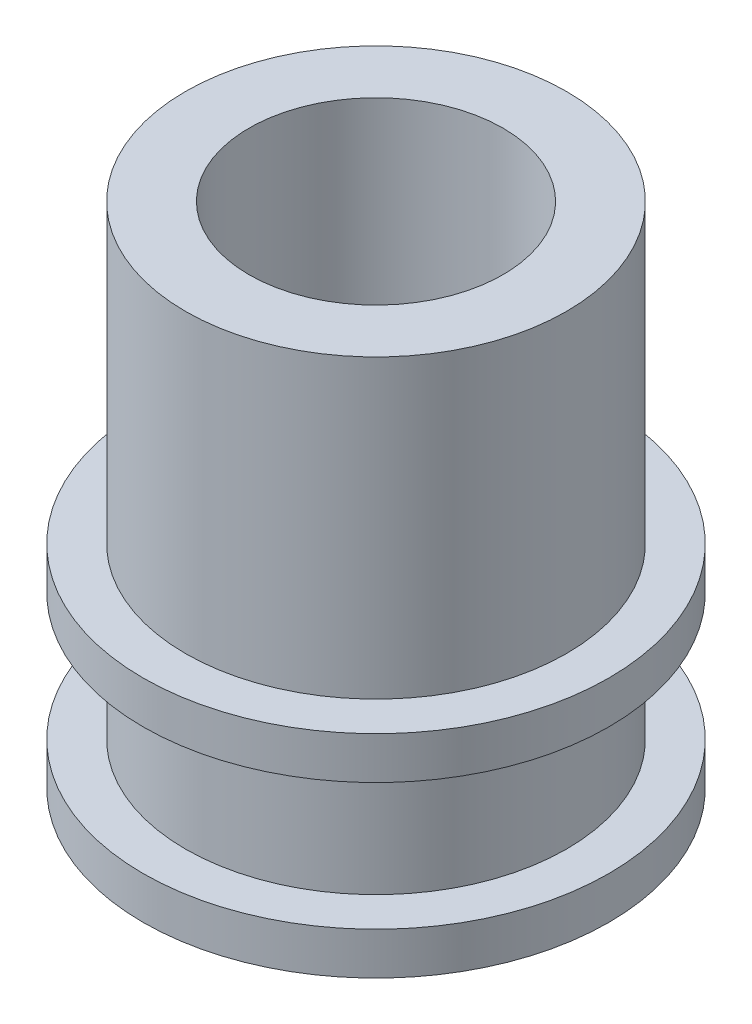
ISO-10303-21;
HEADER;
FILE_DESCRIPTION(('STEP AP214'),'2;1');
FILE_NAME('part.step','',(''),(''),'','','');
FILE_SCHEMA(('AUTOMOTIVE_DESIGN { 1 0 10303 214 1 1 1 1 }'));
ENDSEC;
DATA;
#1=APPLICATION_CONTEXT('core data for automotive mechanical design processes');
#2=APPLICATION_PROTOCOL_DEFINITION('international standard','automotive_design',2000,#1);
#3=PRODUCT_CONTEXT('',#1,'mechanical');
#4=PRODUCT('Part','Part','',(#3));
#5=PRODUCT_RELATED_PRODUCT_CATEGORY('part','',(#4));
#6=PRODUCT_DEFINITION_FORMATION('','',#4);
#7=PRODUCT_DEFINITION_CONTEXT('part definition',#1,'design');
#8=PRODUCT_DEFINITION('design','',#6,#7);
#9=PRODUCT_DEFINITION_SHAPE('','',#8);
#10=(LENGTH_UNIT() NAMED_UNIT(*) SI_UNIT(.MILLI.,.METRE.));
#11=(NAMED_UNIT(*) PLANE_ANGLE_UNIT() SI_UNIT($,.RADIAN.));
#12=(NAMED_UNIT(*) SI_UNIT($,.STERADIAN.) SOLID_ANGLE_UNIT());
#13=UNCERTAINTY_MEASURE_WITH_UNIT(LENGTH_MEASURE(1.E-05),#10,'distance_accuracy_value','');
#14=(GEOMETRIC_REPRESENTATION_CONTEXT(3) GLOBAL_UNCERTAINTY_ASSIGNED_CONTEXT((#13)) GLOBAL_UNIT_ASSIGNED_CONTEXT((#10,
#11,#12)) REPRESENTATION_CONTEXT('',''));
#15=CARTESIAN_POINT('',(0.,0.,0.));
#16=DIRECTION('',(0.,0.,1.));
#17=DIRECTION('',(1.,0.,0.));
#18=AXIS2_PLACEMENT_3D('',#15,#16,#17);
#19=CARTESIAN_POINT('',(-4.5,12.,0.));
#20=DIRECTION('',(0.,-1.,0.));
#21=DIRECTION('',(0.,0.,-1.));
#22=AXIS2_PLACEMENT_3D('',#19,#20,#21);
#23=PLANE('',#22);
#24=CARTESIAN_POINT('',(0.,12.,0.));
#25=DIRECTION('',(0.,-1.,0.));
#26=DIRECTION('',(0.,0.,-1.));
#27=AXIS2_PLACEMENT_3D('',#24,#25,#26);
#28=CIRCLE('',#27,4.5);
#29=CARTESIAN_POINT('',(0.,12.,-4.5));
#30=VERTEX_POINT('',#29);
#31=EDGE_CURVE('E10',#30,#30,#28,.T.);
#32=ORIENTED_EDGE('',*,*,#31,.F.);
#33=EDGE_LOOP('',(#32));
#34=FACE_BOUND('',#33,.T.);
#35=CARTESIAN_POINT('',(0.,12.,0.));
#36=DIRECTION('',(0.,-1.,0.));
#37=DIRECTION('',(0.,0.,-1.));
#38=AXIS2_PLACEMENT_3D('',#35,#36,#37);
#39=CIRCLE('',#38,3.);
#40=CARTESIAN_POINT('',(0.,12.,-3.));
#41=VERTEX_POINT('',#40);
#42=EDGE_CURVE('E62',#41,#41,#39,.T.);
#43=ORIENTED_EDGE('',*,*,#42,.T.);
#44=EDGE_LOOP('',(#43));
#45=FACE_BOUND('',#44,.T.);
#46=ADVANCED_FACE('F28',(#34,#45),#23,.F.);
#47=CARTESIAN_POINT('',(0.,0.,0.));
#48=DIRECTION('',(0.,-1.,0.));
#49=DIRECTION('',(0.,0.,-1.));
#50=AXIS2_PLACEMENT_3D('',#47,#48,#49);
#51=CYLINDRICAL_SURFACE('',#50,4.5);
#52=CARTESIAN_POINT('',(0.,5.,0.));
#53=DIRECTION('',(0.,-1.,0.));
#54=DIRECTION('',(0.,0.,-1.));
#55=AXIS2_PLACEMENT_3D('',#52,#53,#54);
#56=CIRCLE('',#55,4.5);
#57=CARTESIAN_POINT('',(0.,5.,-4.5));
#58=VERTEX_POINT('',#57);
#59=EDGE_CURVE('E34',#58,#58,#56,.T.);
#60=ORIENTED_EDGE('',*,*,#59,.F.);
#61=EDGE_LOOP('',(#60));
#62=FACE_BOUND('',#61,.T.);
#63=ORIENTED_EDGE('',*,*,#31,.T.);
#64=EDGE_LOOP('',(#63));
#65=FACE_BOUND('',#64,.T.);
#66=ADVANCED_FACE('F111',(#62,#65),#51,.T.);
#67=CARTESIAN_POINT('',(-5.5,5.,0.));
#68=DIRECTION('',(0.,-1.,0.));
#69=DIRECTION('',(0.,0.,-1.));
#70=AXIS2_PLACEMENT_3D('',#67,#68,#69);
#71=PLANE('',#70);
#72=CARTESIAN_POINT('',(0.,5.,0.));
#73=DIRECTION('',(0.,-1.,0.));
#74=DIRECTION('',(0.,0.,-1.));
#75=AXIS2_PLACEMENT_3D('',#72,#73,#74);
#76=CIRCLE('',#75,5.5);
#77=CARTESIAN_POINT('',(0.,5.,-5.5));
#78=VERTEX_POINT('',#77);
#79=EDGE_CURVE('E38',#78,#78,#76,.T.);
#80=ORIENTED_EDGE('',*,*,#79,.F.);
#81=EDGE_LOOP('',(#80));
#82=FACE_BOUND('',#81,.T.);
#83=ORIENTED_EDGE('',*,*,#59,.T.);
#84=EDGE_LOOP('',(#83));
#85=FACE_BOUND('',#84,.T.);
#86=ADVANCED_FACE('F106',(#82,#85),#71,.F.);
#87=CARTESIAN_POINT('',(0.,0.,0.));
#88=DIRECTION('',(0.,-1.,0.));
#89=DIRECTION('',(0.,0.,-1.));
#90=AXIS2_PLACEMENT_3D('',#87,#88,#89);
#91=CYLINDRICAL_SURFACE('',#90,5.5);
#92=CARTESIAN_POINT('',(0.,4.,0.));
#93=DIRECTION('',(0.,-1.,0.));
#94=DIRECTION('',(0.,0.,-1.));
#95=AXIS2_PLACEMENT_3D('',#92,#93,#94);
#96=CIRCLE('',#95,5.5);
#97=CARTESIAN_POINT('',(0.,4.,-5.5));
#98=VERTEX_POINT('',#97);
#99=EDGE_CURVE('E42',#98,#98,#96,.T.);
#100=ORIENTED_EDGE('',*,*,#99,.F.);
#101=EDGE_LOOP('',(#100));
#102=FACE_BOUND('',#101,.T.);
#103=ORIENTED_EDGE('',*,*,#79,.T.);
#104=EDGE_LOOP('',(#103));
#105=FACE_BOUND('',#104,.T.);
#106=ADVANCED_FACE('F100',(#102,#105),#91,.T.);
#107=CARTESIAN_POINT('',(-4.5,4.,0.));
#108=DIRECTION('',(0.,1.,0.));
#109=DIRECTION('',(0.,0.,1.));
#110=AXIS2_PLACEMENT_3D('',#107,#108,#109);
#111=PLANE('',#110);
#112=CARTESIAN_POINT('',(0.,4.,0.));
#113=DIRECTION('',(0.,-1.,0.));
#114=DIRECTION('',(0.,0.,-1.));
#115=AXIS2_PLACEMENT_3D('',#112,#113,#114);
#116=CIRCLE('',#115,4.5);
#117=CARTESIAN_POINT('',(0.,4.,-4.5));
#118=VERTEX_POINT('',#117);
#119=EDGE_CURVE('E47',#118,#118,#116,.T.);
#120=ORIENTED_EDGE('',*,*,#119,.F.);
#121=EDGE_LOOP('',(#120));
#122=FACE_BOUND('',#121,.T.);
#123=ORIENTED_EDGE('',*,*,#99,.T.);
#124=EDGE_LOOP('',(#123));
#125=FACE_BOUND('',#124,.T.);
#126=ADVANCED_FACE('F94',(#122,#125),#111,.F.);
#127=CARTESIAN_POINT('',(0.,0.,0.));
#128=DIRECTION('',(0.,-1.,0.));
#129=DIRECTION('',(0.,0.,-1.));
#130=AXIS2_PLACEMENT_3D('',#127,#128,#129);
#131=CYLINDRICAL_SURFACE('',#130,4.5);
#132=CARTESIAN_POINT('',(0.,1.,0.));
#133=DIRECTION('',(0.,-1.,0.));
#134=DIRECTION('',(0.,0.,-1.));
#135=AXIS2_PLACEMENT_3D('',#132,#133,#134);
#136=CIRCLE('',#135,4.5);
#137=CARTESIAN_POINT('',(0.,1.,-4.5));
#138=VERTEX_POINT('',#137);
#139=EDGE_CURVE('E50',#138,#138,#136,.T.);
#140=ORIENTED_EDGE('',*,*,#139,.F.);
#141=EDGE_LOOP('',(#140));
#142=FACE_BOUND('',#141,.T.);
#143=ORIENTED_EDGE('',*,*,#119,.T.);
#144=EDGE_LOOP('',(#143));
#145=FACE_BOUND('',#144,.T.);
#146=ADVANCED_FACE('F88',(#142,#145),#131,.T.);
#147=CARTESIAN_POINT('',(-5.5,1.,0.));
#148=DIRECTION('',(0.,-1.,0.));
#149=DIRECTION('',(0.,0.,-1.));
#150=AXIS2_PLACEMENT_3D('',#147,#148,#149);
#151=PLANE('',#150);
#152=CARTESIAN_POINT('',(0.,1.,0.));
#153=DIRECTION('',(0.,-1.,0.));
#154=DIRECTION('',(0.,0.,-1.));
#155=AXIS2_PLACEMENT_3D('',#152,#153,#154);
#156=CIRCLE('',#155,5.5);
#157=CARTESIAN_POINT('',(0.,1.,-5.5));
#158=VERTEX_POINT('',#157);
#159=EDGE_CURVE('E53',#158,#158,#156,.T.);
#160=ORIENTED_EDGE('',*,*,#159,.F.);
#161=EDGE_LOOP('',(#160));
#162=FACE_BOUND('',#161,.T.);
#163=ORIENTED_EDGE('',*,*,#139,.T.);
#164=EDGE_LOOP('',(#163));
#165=FACE_BOUND('',#164,.T.);
#166=ADVANCED_FACE('F82',(#162,#165),#151,.F.);
#167=CARTESIAN_POINT('',(0.,0.,0.));
#168=DIRECTION('',(0.,-1.,0.));
#169=DIRECTION('',(0.,0.,-1.));
#170=AXIS2_PLACEMENT_3D('',#167,#168,#169);
#171=CYLINDRICAL_SURFACE('',#170,5.5);
#172=CARTESIAN_POINT('',(0.,0.,0.));
#173=DIRECTION('',(0.,-1.,0.));
#174=DIRECTION('',(0.,0.,-1.));
#175=AXIS2_PLACEMENT_3D('',#172,#173,#174);
#176=CIRCLE('',#175,5.5);
#177=CARTESIAN_POINT('',(0.,0.,-5.5));
#178=VERTEX_POINT('',#177);
#179=EDGE_CURVE('E56',#178,#178,#176,.T.);
#180=ORIENTED_EDGE('',*,*,#179,.F.);
#181=EDGE_LOOP('',(#180));
#182=FACE_BOUND('',#181,.T.);
#183=ORIENTED_EDGE('',*,*,#159,.T.);
#184=EDGE_LOOP('',(#183));
#185=FACE_BOUND('',#184,.T.);
#186=ADVANCED_FACE('F76',(#182,#185),#171,.T.);
#187=CARTESIAN_POINT('',(-3.,0.,0.));
#188=DIRECTION('',(0.,1.,0.));
#189=DIRECTION('',(0.,0.,1.));
#190=AXIS2_PLACEMENT_3D('',#187,#188,#189);
#191=PLANE('',#190);
#192=CARTESIAN_POINT('',(0.,0.,0.));
#193=DIRECTION('',(0.,-1.,0.));
#194=DIRECTION('',(0.,0.,-1.));
#195=AXIS2_PLACEMENT_3D('',#192,#193,#194);
#196=CIRCLE('',#195,3.);
#197=CARTESIAN_POINT('',(0.,0.,-3.));
#198=VERTEX_POINT('',#197);
#199=EDGE_CURVE('E59',#198,#198,#196,.T.);
#200=ORIENTED_EDGE('',*,*,#199,.F.);
#201=EDGE_LOOP('',(#200));
#202=FACE_BOUND('',#201,.T.);
#203=ORIENTED_EDGE('',*,*,#179,.T.);
#204=EDGE_LOOP('',(#203));
#205=FACE_BOUND('',#204,.T.);
#206=ADVANCED_FACE('F70',(#202,#205),#191,.F.);
#207=CARTESIAN_POINT('',(0.,0.,0.));
#208=DIRECTION('',(0.,-1.,0.));
#209=DIRECTION('',(0.,0.,-1.));
#210=AXIS2_PLACEMENT_3D('',#207,#208,#209);
#211=CYLINDRICAL_SURFACE('',#210,3.);
#212=ORIENTED_EDGE('',*,*,#42,.F.);
#213=EDGE_LOOP('',(#212));
#214=FACE_BOUND('',#213,.T.);
#215=ORIENTED_EDGE('',*,*,#199,.T.);
#216=EDGE_LOOP('',(#215));
#217=FACE_BOUND('',#216,.T.);
#218=ADVANCED_FACE('F67',(#214,#217),#211,.F.);
#219=CLOSED_SHELL('',(#46,#66,#86,#106,#126,#146,#166,#186,#206,#218));
#220=MANIFOLD_SOLID_BREP('B2',#219);
#221=ADVANCED_BREP_SHAPE_REPRESENTATION('',(#18,#220),#14);
#222=SHAPE_DEFINITION_REPRESENTATION(#9,#221);
ENDSEC;
END-ISO-10303-21;
